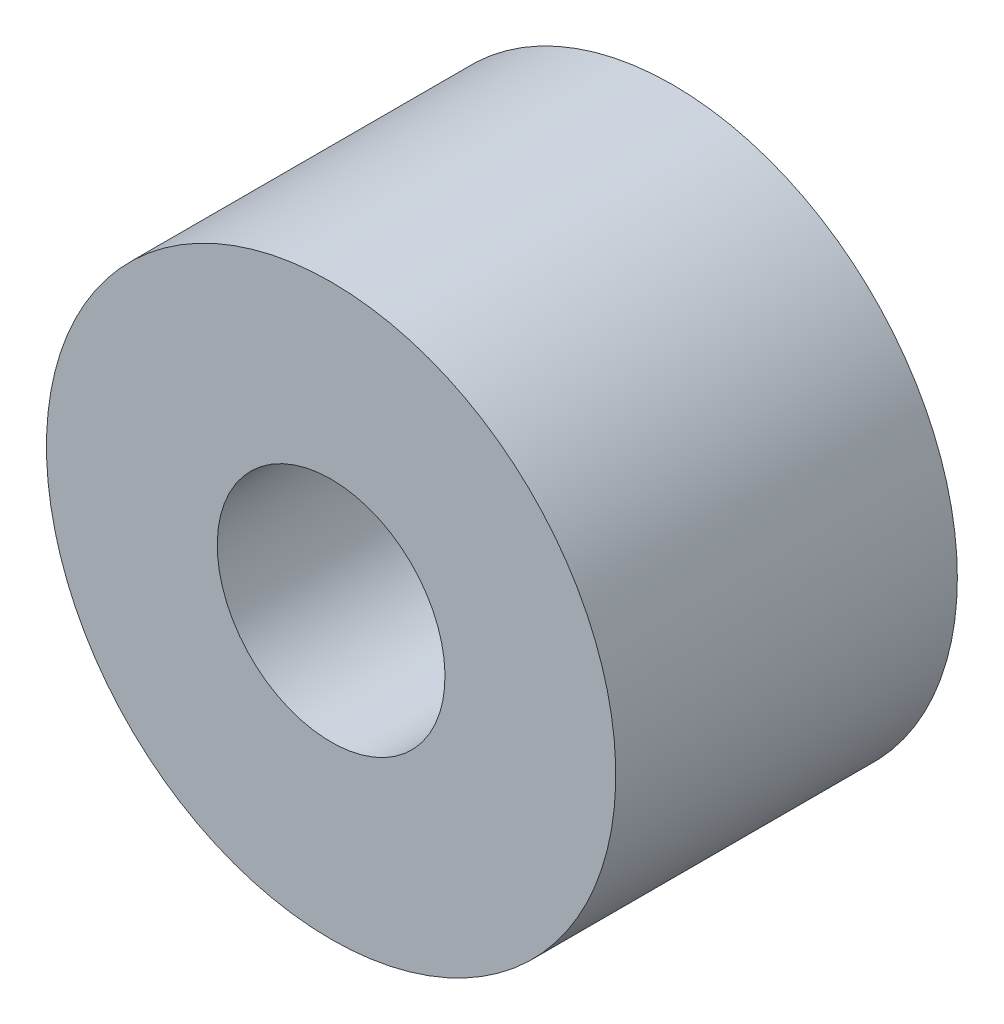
ISO-10303-21;
HEADER;
FILE_DESCRIPTION(('STEP AP214'),'2;1');
FILE_NAME('part.step','',(''),(''),'','','');
FILE_SCHEMA(('AUTOMOTIVE_DESIGN { 1 0 10303 214 1 1 1 1 }'));
ENDSEC;
DATA;
#1=APPLICATION_CONTEXT('core data for automotive mechanical design processes');
#2=APPLICATION_PROTOCOL_DEFINITION('international standard','automotive_design',2000,#1);
#3=PRODUCT_CONTEXT('',#1,'mechanical');
#4=PRODUCT('Part','Part','',(#3));
#5=PRODUCT_RELATED_PRODUCT_CATEGORY('part','',(#4));
#6=PRODUCT_DEFINITION_FORMATION('','',#4);
#7=PRODUCT_DEFINITION_CONTEXT('part definition',#1,'design');
#8=PRODUCT_DEFINITION('design','',#6,#7);
#9=PRODUCT_DEFINITION_SHAPE('','',#8);
#10=(LENGTH_UNIT() NAMED_UNIT(*) SI_UNIT(.MILLI.,.METRE.));
#11=(NAMED_UNIT(*) PLANE_ANGLE_UNIT() SI_UNIT($,.RADIAN.));
#12=(NAMED_UNIT(*) SI_UNIT($,.STERADIAN.) SOLID_ANGLE_UNIT());
#13=UNCERTAINTY_MEASURE_WITH_UNIT(LENGTH_MEASURE(1.E-05),#10,'distance_accuracy_value','');
#14=(GEOMETRIC_REPRESENTATION_CONTEXT(3) GLOBAL_UNCERTAINTY_ASSIGNED_CONTEXT((#13)) GLOBAL_UNIT_ASSIGNED_CONTEXT((#10,
#11,#12)) REPRESENTATION_CONTEXT('',''));
#15=CARTESIAN_POINT('',(0.,0.,0.));
#16=DIRECTION('',(0.,0.,1.));
#17=DIRECTION('',(1.,0.,0.));
#18=AXIS2_PLACEMENT_3D('',#15,#16,#17);
#19=CARTESIAN_POINT('',(25.5875000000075,69.7551585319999,173.948178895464));
#20=DIRECTION('',(0.,0.,1.));
#21=DIRECTION('',(1.,0.,0.));
#22=AXIS2_PLACEMENT_3D('',#19,#20,#21);
#23=PLANE('',#22);
#24=CARTESIAN_POINT('',(25.5875000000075,69.7551585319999,173.948178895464));
#25=DIRECTION('',(0.,0.,1.));
#26=DIRECTION('',(1.,0.,0.));
#27=AXIS2_PLACEMENT_3D('',#24,#25,#26);
#28=CIRCLE('',#27,5.00000000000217);
#29=CARTESIAN_POINT('',(30.5875000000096,69.7551585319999,173.948178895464));
#30=VERTEX_POINT('',#29);
#31=EDGE_CURVE('E52',#30,#30,#28,.T.);
#32=ORIENTED_EDGE('',*,*,#31,.F.);
#33=EDGE_LOOP('',(#32));
#34=FACE_BOUND('',#33,.T.);
#35=CARTESIAN_POINT('',(25.5875000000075,69.7551585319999,173.948178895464));
#36=DIRECTION('',(0.,0.,1.));
#37=DIRECTION('',(1.,0.,0.));
#38=AXIS2_PLACEMENT_3D('',#35,#36,#37);
#39=CIRCLE('',#38,2.00000000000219);
#40=CARTESIAN_POINT('',(27.5875000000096,69.7551585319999,173.948178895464));
#41=VERTEX_POINT('',#40);
#42=EDGE_CURVE('E61',#41,#41,#39,.T.);
#43=ORIENTED_EDGE('',*,*,#42,.T.);
#44=EDGE_LOOP('',(#43));
#45=FACE_BOUND('',#44,.T.);
#46=ADVANCED_FACE('F45',(#34,#45),#23,.F.);
#47=CARTESIAN_POINT('',(25.5875000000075,69.7551585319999,194.090314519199));
#48=DIRECTION('',(0.,0.,-1.));
#49=DIRECTION('',(-1.,0.,0.));
#50=AXIS2_PLACEMENT_3D('',#47,#48,#49);
#51=CYLINDRICAL_SURFACE('',#50,5.00000000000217);
#52=CARTESIAN_POINT('',(25.5875000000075,69.7551585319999,179.948178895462));
#53=DIRECTION('',(0.,0.,-1.));
#54=DIRECTION('',(0.,1.,0.));
#55=AXIS2_PLACEMENT_3D('',#52,#53,#54);
#56=CIRCLE('',#55,5.00000000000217);
#57=CARTESIAN_POINT('',(25.5875000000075,74.7551585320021,179.948178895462));
#58=VERTEX_POINT('',#57);
#59=EDGE_CURVE('E56',#58,#58,#56,.T.);
#60=ORIENTED_EDGE('',*,*,#59,.T.);
#61=EDGE_LOOP('',(#60));
#62=FACE_BOUND('',#61,.T.);
#63=ORIENTED_EDGE('',*,*,#31,.T.);
#64=EDGE_LOOP('',(#63));
#65=FACE_BOUND('',#64,.T.);
#66=ADVANCED_FACE('F69',(#62,#65),#51,.T.);
#67=CARTESIAN_POINT('',(25.5875000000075,69.7551585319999,194.090314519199));
#68=DIRECTION('',(0.,0.,-1.));
#69=DIRECTION('',(-1.,0.,0.));
#70=AXIS2_PLACEMENT_3D('',#67,#68,#69);
#71=CYLINDRICAL_SURFACE('',#70,2.00000000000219);
#72=CARTESIAN_POINT('',(25.5875000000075,69.7551585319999,179.948178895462));
#73=DIRECTION('',(0.,0.,-1.));
#74=DIRECTION('',(0.,1.,0.));
#75=AXIS2_PLACEMENT_3D('',#72,#73,#74);
#76=CIRCLE('',#75,2.00000000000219);
#77=CARTESIAN_POINT('',(25.5875000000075,71.7551585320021,179.948178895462));
#78=VERTEX_POINT('',#77);
#79=EDGE_CURVE('E11',#78,#78,#76,.T.);
#80=ORIENTED_EDGE('',*,*,#79,.F.);
#81=EDGE_LOOP('',(#80));
#82=FACE_BOUND('',#81,.T.);
#83=ORIENTED_EDGE('',*,*,#42,.F.);
#84=EDGE_LOOP('',(#83));
#85=FACE_BOUND('',#84,.T.);
#86=ADVANCED_FACE('F67',(#82,#85),#71,.F.);
#87=CARTESIAN_POINT('',(25.5875000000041,69.7551585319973,179.948178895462));
#88=DIRECTION('',(0.,0.,-1.));
#89=DIRECTION('',(-0.196529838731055,0.980497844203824,0.));
#90=AXIS2_PLACEMENT_3D('',#87,#88,#89);
#91=PLANE('',#90);
#92=ORIENTED_EDGE('',*,*,#79,.T.);
#93=EDGE_LOOP('',(#92));
#94=FACE_BOUND('',#93,.T.);
#95=ORIENTED_EDGE('',*,*,#59,.F.);
#96=EDGE_LOOP('',(#95));
#97=FACE_BOUND('',#96,.T.);
#98=ADVANCED_FACE('F47',(#94,#97),#91,.F.);
#99=CLOSED_SHELL('',(#46,#66,#86,#98));
#100=MANIFOLD_SOLID_BREP('B2',#99);
#101=ADVANCED_BREP_SHAPE_REPRESENTATION('',(#18,#100),#14);
#102=SHAPE_DEFINITION_REPRESENTATION(#9,#101);
ENDSEC;
END-ISO-10303-21;
